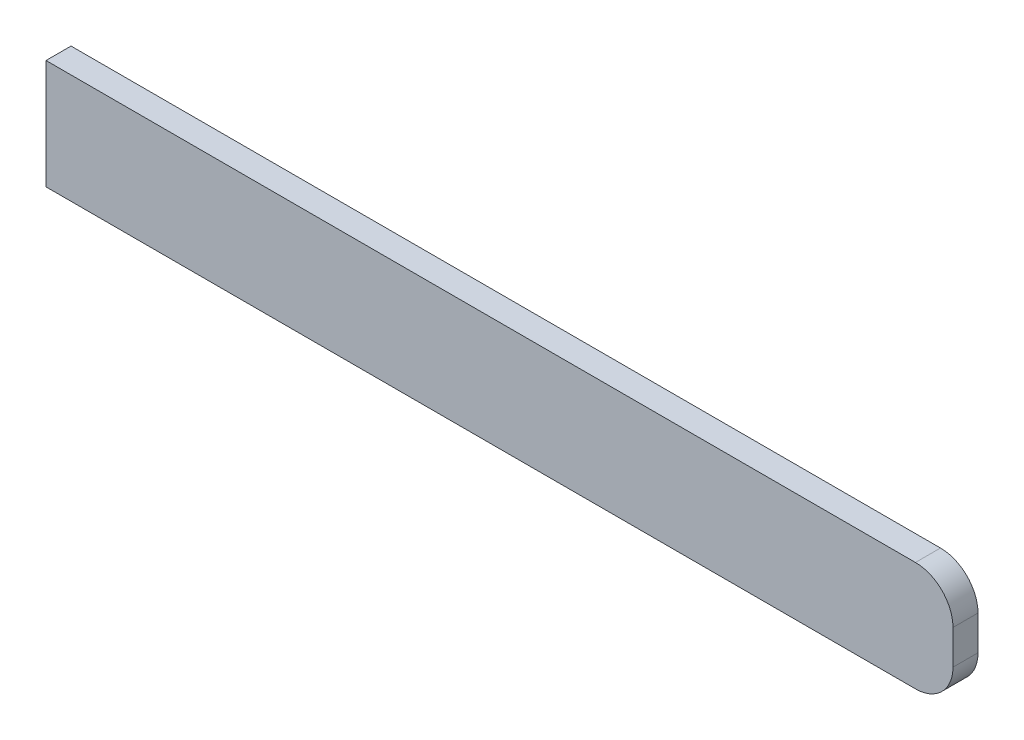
from build123d import *

# Parameters (mm, degrees)
SKICA1_W        = 290
SKICA1_H        = 35
VYSUNOUT1_DEPTH = 8
ZAOBLIT1_R      = 12


with BuildPart() as part:
    # Skica1 → Vysunout1 (new body)
    with BuildSketch(Plane.XY):
        Rectangle(SKICA1_W, SKICA1_H)
    extrude(amount=VYSUNOUT1_DEPTH)

    # Zaoblit1
    zaoblit1_edges = [part.edges().sort_by_distance(p)[0] for p in [
        (145, 17.5, 4),
        (145, -17.5, 4),
    ]]
    fillet(zaoblit1_edges, radius=ZAOBLIT1_R)


solid = part.part
